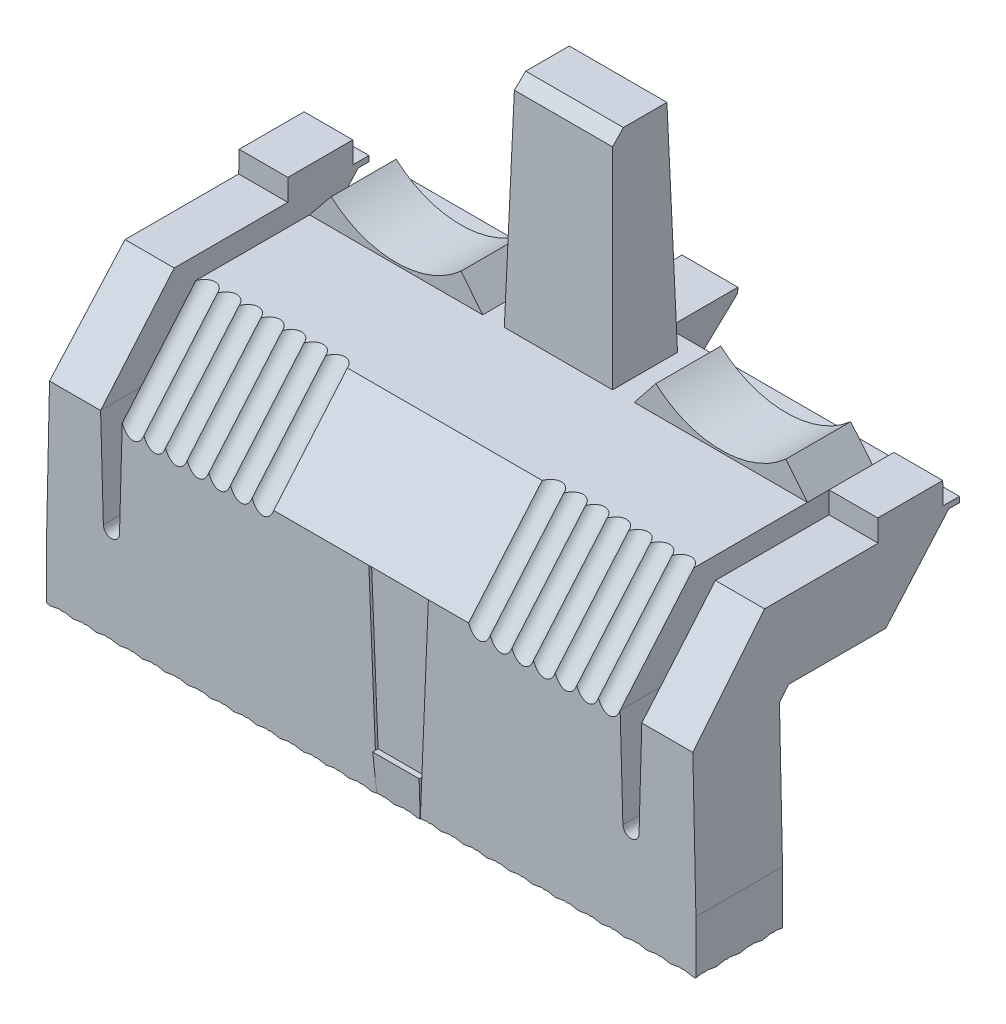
from build123d import *

# Parameters (mm, degrees)
EXTRUSION1_DEPTH         = 30
ENL_V_MAT_EXTRU_1_DEPTH  = 54.019585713
ESQUISSE4_R              = 9
ENL_V_MAT_EXTRU_2_DEPTH  = 54.019585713
D_POUILLE3_ANGLE         = 1.4
D_POUILLE4_ANGLE         = 1.4
D_POUILLE5_ANGLE         = 1.4
D_POUILLE6_ANGLE         = 1.4
CHANFREIN2_SIZE          = 1
CHANFREIN2_SIZE2         = 1.025357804
EXTRUSION2_DEPTH         = 2.25
ESQUISSE8_W              = 6.5
ESQUISSE8_H              = 0.5
EXTRUSION3_DEPTH         = 4.5
D_POUILLE7_ANGLE         = 2.7
D_POUILLE8_ANGLE         = 2.7
ENL_V_MAT_EXTRU_4_DEPTH  = 0.25
EXTRUSION4_DEPTH         = 0.5
ENL_V_MAT_EXTRU_6_DEPTH  = 55.234031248
EXTRUSION5_DEPTH         = 1
ESQUISSE13_W             = 1
ESQUISSE13_H             = 20.72029686
EXTRUSION6_DEPTH         = 1
ESQUISSE14_W             = 5
ESQUISSE14_H             = 3.5
ENL_V_MAT_EXTRU_8_DEPTH  = 3
ENL_V_MAT_EXTRU_9_DEPTH  = 25
ENL_V_MAT_EXTRU_13_DEPTH = 63.90121223
ENL_V_MAT_EXTRU_14_DEPTH = 74.942918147


with BuildPart() as part:
    # Esquisse1 → Extrusion1 (new, symmetric)
    with BuildSketch(Plane(origin=(0, 0, 0), x_dir=(0, 0, -1), z_dir=(1, 0, 0))):
        Polygon((-4, -10), (4, -10), (4, 8), (4.850091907, 9), (13.850091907, 9), (19.800735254, 15.5), (20.800735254, 15.5), (20.800735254, 16), (19.300735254, 16), (19.300735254, 36), (13.300735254, 36), (13.300735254, 16), (2.800735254, 16), (-4, 8), align=None)
    extrude(amount=EXTRUSION1_DEPTH, both=True)

    # Esquisse3 → Enl_v. mat.-Extru.1 (cut, through all)
    with BuildSketch(Plane.XY.offset(4)):
        with BuildLine():
            Line((-30, -5), (-30, 37.01927998))
            Line((-30, 37.01927998), (-5, 37.01927998))
            Line((-5, 37.01927998), (-5, 16))
            Line((-5, 16), (-7, 16))
            Line((-7, 16), (-9, 18.5))
            Line((-9, 18.5), (-21, 18.452773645))
            Line((-21, 18.452773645), (-23, 16))
            Line((-23, 16), (-23, 8))
            Line((-23, 8), (-23.25337766, -1.02097085))
            ThreePointArc((-23.25337766, -1.02097085), (-24.000000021, -1.746916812), (-24.746622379, -1.020970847))
            Line((-24.746622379, -1.020970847), (-25, 8))
            Line((-25, 8), (-25, 18))
            Line((-25, 18), (-29.5, 18))
            Line((-29.5, 18), (-30, -5))
        make_face()
        with BuildLine():
            Line((21, 18.452773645), (9, 18.5))
            Line((9, 18.5), (7, 16))
            Line((7, 16), (5, 16))
            Line((5, 16), (5, 37.01927998))
            Line((5, 37.01927998), (30, 37.01927998))
            Line((30, 37.01927998), (30, -5))
            Line((30, -5), (29.5, 18))
            Line((29.5, 18), (25, 18))
            Line((25, 18), (25, 8))
            Line((25, 8), (24.746622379, -1.020970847))
            ThreePointArc((24.746622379, -1.020970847), (24.000000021, -1.746916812), (23.25337766, -1.02097085))
            Line((23.25337766, -1.02097085), (23, 8))
            Line((23, 8), (23, 16))
            Line((23, 16), (21, 18.452773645))
        make_face()
    extrude(amount=-ENL_V_MAT_EXTRU_1_DEPTH, mode=Mode.SUBTRACT)

    # Esquisse4 → Enl_v. mat.-Extru.2 (cut, through all)
    with BuildSketch(Plane.XY.offset(4)):
        with Locations((-15.026399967, 25.184497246)):
            Circle(ESQUISSE4_R)
        with Locations((15.026399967, 25.184497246)):
            Circle(ESQUISSE4_R)
    extrude(amount=-ENL_V_MAT_EXTRU_2_DEPTH, mode=Mode.SUBTRACT)

    # D_pouille3
    d_pouille3_faces = [part.faces().sort_by_distance(p)[0] for p in [
        (-5, 26, -16.300735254),
    ]]
    draft(d_pouille3_faces, Plane(origin=(30, 16, -19.300735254), x_dir=(0, 0, 1), z_dir=(0, 1, 0)), D_POUILLE3_ANGLE)

    # D_pouille4
    d_pouille4_faces = [part.faces().sort_by_distance(p)[0] for p in [
        (0.12117695, 25.916494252, -13.300735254),
    ]]
    draft(d_pouille4_faces, Plane(origin=(30, 16, -19.300735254), x_dir=(0, 0, 1), z_dir=(0, 1, 0)), D_POUILLE4_ANGLE)

    # D_pouille5
    d_pouille5_faces = [part.faces().sort_by_distance(p)[0] for p in [
        (5, 25.85845987, -16.421203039),
    ]]
    draft(d_pouille5_faces, Plane(origin=(30, 16, -19.300735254), x_dir=(0, 0, 1), z_dir=(0, 1, 0)), D_POUILLE5_ANGLE)

    # D_pouille6
    d_pouille6_faces = [part.faces().sort_by_distance(p)[0] for p in [
        (0, 25.828697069, -19.300735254),
    ]]
    draft(d_pouille6_faces, Plane(origin=(30, 16, -19.300735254), x_dir=(0, 0, 1), z_dir=(0, 1, 0)), D_POUILLE6_ANGLE)

    # Chanfrein2
    chanfrein2_edges = [part.edges().sort_by_distance(p)[0] for p in [
        (0, 36, -13.789524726),
    ]]
    chanfrein2_side = [part.faces().sort_by_distance(p)[0] for p in [
        (0, 36, -16.300735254),
    ]]
    chamfer(chanfrein2_edges, length=CHANFREIN2_SIZE, length2=CHANFREIN2_SIZE2, reference=chanfrein2_side[0])

    # Esquisse7 → Extrusion2 (add, symmetric)
    with BuildSketch(Plane(origin=(0, 0, 0), x_dir=(0, 0, -1), z_dir=(1, 0, 0))):
        with BuildLine():
            Line((5.5, 6.5), (6, -2.5))
            Line((6, -2.5), (10, -2.5))
            Line((10, -2.5), (27.300735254, 15.5))
            Line((27.300735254, 15.5), (19.800735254, 15.5))
            Line((19.800735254, 15.5), (13.850091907, 9))
            Line((13.850091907, 9), (4.850091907, 9))
            Line((4.850091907, 9), (4, 8))
            ThreePointArc((4, 8), (5.036548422, 7.536548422), (5.5, 6.5))
        make_face()
    extrude(amount=EXTRUSION2_DEPTH, both=True)

    # Esquisse8 → Extrusion3 (add)
    with BuildSketch(Plane(origin=(2.25, 0, 0), x_dir=(0, 0, -1), z_dir=(1, 0, 0))):
        with Locations((24.050735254, 15.75)):
            Rectangle(ESQUISSE8_W, ESQUISSE8_H)
    extrude(amount=-EXTRUSION3_DEPTH)

    # D_pouille7
    d_pouille7_faces = [part.faces().sort_by_distance(p)[0] for p in [
        (2.25, 6.917239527, -14.030638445),
    ]]
    draft(d_pouille7_faces, Plane(origin=(30, 9, -4.850091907), x_dir=(0, 0, -1), z_dir=(0, -1, 0)), D_POUILLE7_ANGLE)

    # D_pouille8
    d_pouille8_faces = [part.faces().sort_by_distance(p)[0] for p in [
        (-2.25, 6.917239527, -14.030638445),
    ]]
    draft(d_pouille8_faces, Plane(origin=(30, 9, -4.850091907), x_dir=(0, 0, -1), z_dir=(0, -1, 0)), D_POUILLE8_ANGLE)

    # Esquisse9 → Enl_v. mat.-Extru.4 (cut)
    with BuildSketch(Plane.XY.offset(4)):
        Polygon((-0.217391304, 8), (0.532608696, -10), (4.532608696, -10), (5.282608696, 8), align=None)
    extrude(amount=-ENL_V_MAT_EXTRU_4_DEPTH, mode=Mode.SUBTRACT)

    # Esquisse10 → Extrusion4 (add)
    with BuildSketch(Plane.XY.offset(3.75)):
        Polygon((0.532608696, -10), (4.532608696, -10), (4.678442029, -6.5), (0.386775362, -6.5), align=None)
    extrude(amount=EXTRUSION4_DEPTH)

    # Esquisse11 → Enl_v. mat.-Extru.6 (cut, through all)
    with BuildSketch(Plane(origin=(0, 0, 0), x_dir=(0, 0, -1), z_dir=(1, 0, 0))):
        Polygon((-4.25, -6.5), (-4, -10), (-4.25, -10), align=None)
    extrude(amount=ENL_V_MAT_EXTRU_6_DEPTH, mode=Mode.SUBTRACT)

    # Esquisse12 → Extrusion5 (add)
    with BuildSketch(Plane(origin=(0, 0, -4), x_dir=(-1, 0, 0), z_dir=(0, 0, -1))):
        Polygon((28.8, 11.92915798), (28.2, -4), (27.2, -4), (26.6, 11.92915798), align=None)
        Polygon((-26.6, 11.92915798), (-28.8, 11.92915798), (-28.2, -4), (-27.2, -4), align=None)
    extrude(amount=EXTRUSION5_DEPTH)

    # Esquisse13 → Extrusion6 (add)
    with BuildSketch(Plane(origin=(0, 0, -4), x_dir=(-1, 0, 0), z_dir=(0, 0, -1))):
        with Locations((3.5, 0.86014843)):
            Rectangle(ESQUISSE13_W, ESQUISSE13_H)
    extrude(amount=EXTRUSION6_DEPTH)

    # Esquisse14 → Enl_v. mat.-Extru.8 (cut)
    with BuildSketch(Plane(origin=(0, 0.480969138, -19.680012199), x_dir=(-1, 0, 0), z_dir=(0, 0.024432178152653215, -0.9997014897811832))):
        with Locations((0, 29.779636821)):
            Rectangle(ESQUISSE14_W, ESQUISSE14_H)
    extrude(amount=-ENL_V_MAT_EXTRU_8_DEPTH, mode=Mode.SUBTRACT)

    # Esquisse15 → Enl_v. mat.-Extru.9 (cut, symmetric)
    with BuildSketch(Plane(origin=(0, 2.670081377, -2.269814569), x_dir=(-1, 0, 0), z_dir=(0, 0.7619047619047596, -0.6476890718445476))):
        with BuildLine():
            Line((9, 8.229131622), (9, 10.700565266))
            Line((9, 10.700565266), (23, 10.434083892))
            Line((23, 10.434083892), (23, 8.229131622))
            ThreePointArc((23, 8.229131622), (22, 7.635989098), (21, 8.229131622))
            ThreePointArc((21, 8.229131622), (20, 7.635989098), (19, 8.229131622))
            ThreePointArc((19, 8.229131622), (18, 7.635989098), (17, 8.229131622))
            ThreePointArc((17, 8.229131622), (16, 7.635989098), (15, 8.229131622))
            ThreePointArc((15, 8.229131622), (14, 7.635989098), (13, 8.229131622))
            ThreePointArc((13, 8.229131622), (12, 7.635989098), (11, 8.229131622))
            ThreePointArc((11, 8.229131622), (10, 7.635989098), (9, 8.229131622))
        make_face()
        with BuildLine():
            Line((-23, 10.434083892), (-23, 8.229131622))
            ThreePointArc((-23, 8.229131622), (-22, 7.635989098), (-21, 8.229131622))
            ThreePointArc((-21, 8.229131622), (-20, 7.635989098), (-19, 8.229131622))
            ThreePointArc((-19, 8.229131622), (-18, 7.635989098), (-17, 8.229131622))
            ThreePointArc((-17, 8.229131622), (-16, 7.635989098), (-15, 8.229131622))
            ThreePointArc((-15, 8.229131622), (-14, 7.635989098), (-13, 8.229131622))
            ThreePointArc((-13, 8.229131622), (-12, 7.635989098), (-11, 8.229131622))
            ThreePointArc((-11, 8.229131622), (-10, 7.635989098), (-9, 8.229131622))
            Line((-9, 8.229131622), (-9, 10.700565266))
            Line((-9, 10.700565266), (-23, 10.434083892))
        make_face()
    extrude(amount=ENL_V_MAT_EXTRU_9_DEPTH, both=True, mode=Mode.SUBTRACT)

    # Esquisse20 → Enl_v. mat.-Extru.13 (cut, through all)
    with BuildSketch(Plane(origin=(17, 0, -17), x_dir=(-0.7071067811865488, 0, -0.7071067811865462), z_dir=(0.7071067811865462, 0, -0.7071067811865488))):
        Polygon((-22.54163056, -10), (-21.79163056, -9.8), (-21.04163056, -10), (-20.29163056, -9.8), (-19.54163056, -10), (-18.79163056, -9.8), (-18.04163056, -10), (-17.29163056, -9.8), (-16.54163056, -10), (-15.79163056, -9.8), (-15.04163056, -10), (-14.29163056, -9.8), (-13.54163056, -10), (-12.79163056, -9.8), (-12.04163056, -10), (-11.29163056, -9.8), (-10.54163056, -10), (-9.79163056, -9.8), (-9.04163056, -10), (-8.29163056, -9.8), (-7.54163056, -10), (-6.79163056, -9.8), (-6.04163056, -10), (-5.29163056, -9.8), (-4.54163056, -10), (-3.79163056, -9.8), (-3.04163056, -10), (-2.29163056, -9.8), (-1.54163056, -10), (-0.79163056, -9.8), (-0.04163056, -10), (0.70836944, -9.8), (1.45836944, -10), (2.20836944, -9.8), (2.95836944, -10), (3.70836944, -9.8), (4.45836944, -10), (5.20836944, -9.8), (5.95836944, -10), (6.70836944, -9.8), (7.45836944, -10), (8.20836944, -9.8), (8.95836944, -10), (9.70836944, -9.8), (10.45836944, -10), (11.20836944, -9.8), (11.95836944, -10), (12.70836944, -9.8), (13.45836944, -10), (14.20836944, -9.8), (14.95836944, -10), (15.70836944, -9.8), (16.45836944, -10), (17.20836944, -9.8), (17.95836944, -10), (18.70836944, -9.8), (19.45836944, -10), (20.20836944, -9.8), (20.95836944, -10), (21.70836944, -9.8), (22.45836944, -10), (23.20836944, -9.8), (23.95836944, -10), (24.70836944, -9.8), (25.45836944, -10), (26.20836944, -9.8), (26.95836944, -10), (27.70836944, -9.8), (28.45836944, -10), (29.20836944, -9.8), (29.95836944, -10), (30.70836944, -9.8), (31.45836944, -10), (32.20836944, -9.8), (32.95836944, -10), (33.70836944, -9.8), (34.45836944, -10), (35.20836944, -9.8), (35.95836944, -10), (35.95836944, -10.905035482), (-24.04163056, -10.905035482), (-24.04163056, -10), (-23.29163056, -9.8), align=None)
    extrude(amount=-ENL_V_MAT_EXTRU_13_DEPTH, mode=Mode.SUBTRACT)

    # Esquisse21 → Enl_v. mat.-Extru.14 (cut, through all)
    with BuildSketch(Plane(origin=(17, 0, 17), x_dir=(0.7071067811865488, 0, -0.7071067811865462), z_dir=(0.7071067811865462, 0, 0.7071067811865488))):
        Polygon((24.04163056, -10), (23.29163056, -9.8), (22.54163056, -10), (21.79163056, -9.8), (21.04163056, -10), (20.29163056, -9.8), (19.54163056, -10), (18.79163056, -9.8), (18.04163056, -10), (17.29163056, -9.8), (16.54163056, -10), (15.79163056, -9.8), (15.04163056, -10), (14.29163056, -9.8), (13.54163056, -10), (12.79163056, -9.8), (12.04163056, -10), (11.29163056, -9.8), (10.54163056, -10), (9.79163056, -9.8), (9.04163056, -10), (8.29163056, -9.8), (7.54163056, -10), (6.79163056, -9.8), (6.04163056, -10), (5.29163056, -9.8), (4.54163056, -10), (3.79163056, -9.8), (3.04163056, -10), (2.29163056, -9.8), (1.54163056, -10), (0.79163056, -9.8), (0.04163056, -10), (-0.70836944, -9.8), (-1.45836944, -10), (-2.20836944, -9.8), (-2.95836944, -10), (-3.70836944, -9.8), (-4.45836944, -10), (-5.20836944, -9.8), (-5.95836944, -10), (-6.70836944, -9.8), (-7.45836944, -10), (-8.20836944, -9.8), (-8.95836944, -10), (-9.70836944, -9.8), (-10.45836944, -10), (-11.20836944, -9.8), (-11.95836944, -10), (-12.70836944, -9.8), (-13.45836944, -10), (-14.20836944, -9.8), (-14.95836944, -10), (-15.70836944, -9.8), (-16.45836944, -10), (-17.20836944, -9.8), (-17.95836944, -10), (-18.70836944, -9.8), (-19.45836944, -10), (-20.20836944, -9.8), (-20.95836944, -10), (-21.70836944, -9.8), (-22.45836944, -10), (-23.20836944, -9.8), (-23.95836944, -10), (-24.70836944, -9.8), (-25.45836944, -10), (-26.20836944, -9.8), (-26.95836944, -10), (-27.70836944, -9.8), (-28.45836944, -10), (-29.20836944, -9.8), (-29.95836944, -10), (-30.70836944, -9.8), (-31.45836944, -10), (-32.20836944, -9.8), (-32.95836944, -10), (-33.70836944, -9.8), (-34.45836944, -10), (-35.20836944, -9.8), (-35.95836944, -10), (-35.95836944, -10.2686692), (24.04163056, -10.40187796), align=None)
    extrude(amount=-ENL_V_MAT_EXTRU_14_DEPTH, mode=Mode.SUBTRACT)


solid = part.part
